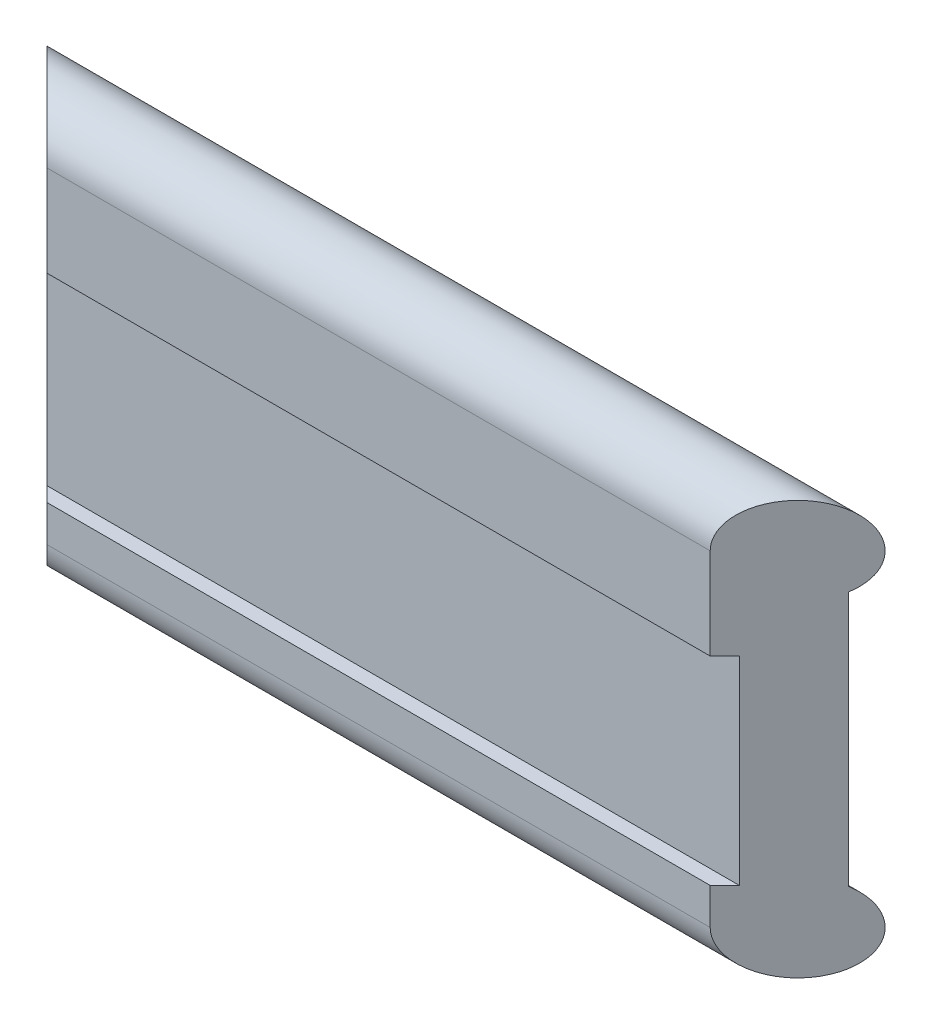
ISO-10303-21;
HEADER;
FILE_DESCRIPTION(('STEP AP214'),'2;1');
FILE_NAME('part.step','',(''),(''),'','','');
FILE_SCHEMA(('AUTOMOTIVE_DESIGN { 1 0 10303 214 1 1 1 1 }'));
ENDSEC;
DATA;
#1=APPLICATION_CONTEXT('core data for automotive mechanical design processes');
#2=APPLICATION_PROTOCOL_DEFINITION('international standard','automotive_design',2000,#1);
#3=PRODUCT_CONTEXT('',#1,'mechanical');
#4=PRODUCT('Part','Part','',(#3));
#5=PRODUCT_RELATED_PRODUCT_CATEGORY('part','',(#4));
#6=PRODUCT_DEFINITION_FORMATION('','',#4);
#7=PRODUCT_DEFINITION_CONTEXT('part definition',#1,'design');
#8=PRODUCT_DEFINITION('design','',#6,#7);
#9=PRODUCT_DEFINITION_SHAPE('','',#8);
#10=(LENGTH_UNIT() NAMED_UNIT(*) SI_UNIT(.MILLI.,.METRE.));
#11=(NAMED_UNIT(*) PLANE_ANGLE_UNIT() SI_UNIT($,.RADIAN.));
#12=(NAMED_UNIT(*) SI_UNIT($,.STERADIAN.) SOLID_ANGLE_UNIT());
#13=UNCERTAINTY_MEASURE_WITH_UNIT(LENGTH_MEASURE(1.E-05),#10,'distance_accuracy_value','');
#14=(GEOMETRIC_REPRESENTATION_CONTEXT(3) GLOBAL_UNCERTAINTY_ASSIGNED_CONTEXT((#13)) GLOBAL_UNIT_ASSIGNED_CONTEXT((#10,
#11,#12)) REPRESENTATION_CONTEXT('',''));
#15=CARTESIAN_POINT('',(0.,0.,0.));
#16=DIRECTION('',(0.,0.,1.));
#17=DIRECTION('',(1.,0.,0.));
#18=AXIS2_PLACEMENT_3D('',#15,#16,#17);
#19=CARTESIAN_POINT('',(0.,0.,15.));
#20=DIRECTION('',(0.,0.,-1.));
#21=DIRECTION('',(-1.,0.,0.));
#22=AXIS2_PLACEMENT_3D('',#19,#20,#21);
#23=PLANE('',#22);
#24=DIRECTION('',(-1.,0.,0.));
#25=VECTOR('',#24,1.);
#26=CARTESIAN_POINT('',(-115.,27.25,15.));
#27=LINE('',#26,#25);
#28=CARTESIAN_POINT('',(95.0000000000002,27.25,15.));
#29=VERTEX_POINT('',#28);
#30=CARTESIAN_POINT('',(-95.0000000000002,27.25,15.));
#31=VERTEX_POINT('',#30);
#32=EDGE_CURVE('E37',#29,#31,#27,.T.);
#33=ORIENTED_EDGE('',*,*,#32,.T.);
#34=DIRECTION('',(0.,-1.,0.));
#35=VECTOR('',#34,1.);
#36=CARTESIAN_POINT('',(-95.0000000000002,0.,15.));
#37=LINE('',#36,#35);
#38=CARTESIAN_POINT('',(-95.0000000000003,-27.25,15.));
#39=VERTEX_POINT('',#38);
#40=EDGE_CURVE('E57',#31,#39,#37,.T.);
#41=ORIENTED_EDGE('',*,*,#40,.T.);
#42=DIRECTION('',(1.,0.,0.));
#43=VECTOR('',#42,1.);
#44=CARTESIAN_POINT('',(-115.,-27.25,15.));
#45=LINE('',#44,#43);
#46=CARTESIAN_POINT('',(95.0000000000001,-27.25,15.));
#47=VERTEX_POINT('',#46);
#48=EDGE_CURVE('E106',#39,#47,#45,.T.);
#49=ORIENTED_EDGE('',*,*,#48,.T.);
#50=DIRECTION('',(0.,1.,0.));
#51=VECTOR('',#50,1.);
#52=CARTESIAN_POINT('',(95.0000000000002,0.,15.));
#53=LINE('',#52,#51);
#54=EDGE_CURVE('E146',#47,#29,#53,.T.);
#55=ORIENTED_EDGE('',*,*,#54,.T.);
#56=EDGE_LOOP('',(#33,#41,#49,#55));
#57=FACE_BOUND('',#56,.T.);
#58=ADVANCED_FACE('F33',(#57),#23,.F.);
#59=CARTESIAN_POINT('',(0.,0.,0.));
#60=DIRECTION('',(0.,0.,-1.));
#61=DIRECTION('',(-1.,0.,0.));
#62=AXIS2_PLACEMENT_3D('',#59,#60,#61);
#63=PLANE('',#62);
#64=DIRECTION('',(0.,-1.,0.));
#65=VECTOR('',#64,1.);
#66=CARTESIAN_POINT('',(-110.,0.,0.));
#67=LINE('',#66,#65);
#68=CARTESIAN_POINT('',(-110.,42.503205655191,0.));
#69=VERTEX_POINT('',#68);
#70=CARTESIAN_POINT('',(-110.,-27.503205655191,0.));
#71=VERTEX_POINT('',#70);
#72=EDGE_CURVE('E159',#69,#71,#67,.T.);
#73=ORIENTED_EDGE('',*,*,#72,.F.);
#74=DIRECTION('',(-1.,0.,0.));
#75=VECTOR('',#74,1.);
#76=CARTESIAN_POINT('',(159.1021541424,42.503205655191,0.));
#77=LINE('',#76,#75);
#78=CARTESIAN_POINT('',(110.,42.503205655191,0.));
#79=VERTEX_POINT('',#78);
#80=EDGE_CURVE('E130',#79,#69,#77,.T.);
#81=ORIENTED_EDGE('',*,*,#80,.F.);
#82=DIRECTION('',(0.,1.,0.));
#83=VECTOR('',#82,1.);
#84=CARTESIAN_POINT('',(110.,0.,0.));
#85=LINE('',#84,#83);
#86=CARTESIAN_POINT('',(110.,-27.503205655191,0.));
#87=VERTEX_POINT('',#86);
#88=EDGE_CURVE('E166',#87,#79,#85,.T.);
#89=ORIENTED_EDGE('',*,*,#88,.F.);
#90=DIRECTION('',(-1.,0.,0.));
#91=VECTOR('',#90,1.);
#92=CARTESIAN_POINT('',(159.1021541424,-27.503205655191,0.));
#93=LINE('',#92,#91);
#94=EDGE_CURVE('E102',#87,#71,#93,.T.);
#95=ORIENTED_EDGE('',*,*,#94,.T.);
#96=EDGE_LOOP('',(#73,#81,#89,#95));
#97=FACE_BOUND('',#96,.T.);
#98=ADVANCED_FACE('F35',(#97),#63,.T.);
#99=CARTESIAN_POINT('',(159.1021541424,27.25,15.));
#100=DIRECTION('',(0.,-1.,0.));
#101=DIRECTION('',(0.,0.,-1.));
#102=AXIS2_PLACEMENT_3D('',#99,#100,#101);
#103=PLANE('',#102);
#104=DIRECTION('',(0.707106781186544,0.,0.707106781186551));
#105=VECTOR('',#104,1.);
#106=CARTESIAN_POINT('',(32.0510770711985,27.25,142.0510770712));
#107=LINE('',#106,#105);
#108=CARTESIAN_POINT('',(-91.0000000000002,27.25,19.));
#109=VERTEX_POINT('',#108);
#110=EDGE_CURVE('E126',#31,#109,#107,.T.);
#111=ORIENTED_EDGE('',*,*,#110,.F.);
#112=ORIENTED_EDGE('',*,*,#32,.F.);
#113=DIRECTION('',(0.707106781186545,0.,-0.70710678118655));
#114=VECTOR('',#113,1.);
#115=CARTESIAN_POINT('',(127.0510770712,27.25,-17.0510770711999));
#116=LINE('',#115,#114);
#117=CARTESIAN_POINT('',(91.0000000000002,27.25,19.));
#118=VERTEX_POINT('',#117);
#119=EDGE_CURVE('E150',#118,#29,#116,.T.);
#120=ORIENTED_EDGE('',*,*,#119,.F.);
#121=DIRECTION('',(-1.,0.,0.));
#122=VECTOR('',#121,1.);
#123=CARTESIAN_POINT('',(159.1021541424,27.25,19.));
#124=LINE('',#123,#122);
#125=EDGE_CURVE('E124',#118,#109,#124,.T.);
#126=ORIENTED_EDGE('',*,*,#125,.T.);
#127=EDGE_LOOP('',(#111,#112,#120,#126));
#128=FACE_BOUND('',#127,.T.);
#129=ADVANCED_FACE('F149',(#128),#103,.T.);
#130=CARTESIAN_POINT('',(159.1021541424,52.25,7.));
#131=DIRECTION('',(-1.,0.,0.));
#132=DIRECTION('',(0.,0.,1.));
#133=AXIS2_PLACEMENT_3D('',#130,#131,#132);
#134=CYLINDRICAL_SURFACE('',#133,12.);
#135=CARTESIAN_POINT('',(-103.,52.25,7.));
#136=DIRECTION('',(0.707106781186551,0.,-0.707106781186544));
#137=DIRECTION('',(-0.707106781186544,0.,-0.707106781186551));
#138=AXIS2_PLACEMENT_3D('',#135,#136,#137);
#139=ELLIPSE('',#138,16.970562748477,12.);
#140=CARTESIAN_POINT('',(-91.0000000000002,52.25,19.));
#141=VERTEX_POINT('',#140);
#142=EDGE_CURVE('E157',#141,#69,#139,.F.);
#143=ORIENTED_EDGE('',*,*,#142,.F.);
#144=DIRECTION('',(-1.,0.,0.));
#145=VECTOR('',#144,1.);
#146=CARTESIAN_POINT('',(159.1021541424,52.25,19.));
#147=LINE('',#146,#145);
#148=CARTESIAN_POINT('',(91.0000000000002,52.25,19.));
#149=VERTEX_POINT('',#148);
#150=EDGE_CURVE('E133',#149,#141,#147,.T.);
#151=ORIENTED_EDGE('',*,*,#150,.F.);
#152=CARTESIAN_POINT('',(103.,52.25,7.));
#153=DIRECTION('',(-0.70710678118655,0.,-0.707106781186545));
#154=DIRECTION('',(-0.707106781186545,0.,0.70710678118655));
#155=AXIS2_PLACEMENT_3D('',#152,#153,#154);
#156=ELLIPSE('',#155,16.9705627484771,12.);
#157=EDGE_CURVE('E164',#79,#149,#156,.F.);
#158=ORIENTED_EDGE('',*,*,#157,.F.);
#159=ORIENTED_EDGE('',*,*,#80,.T.);
#160=EDGE_LOOP('',(#143,#151,#158,#159));
#161=FACE_BOUND('',#160,.T.);
#162=ADVANCED_FACE('F182',(#161),#134,.T.);
#163=CARTESIAN_POINT('',(159.1021541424,27.25,19.));
#164=DIRECTION('',(0.,0.,1.));
#165=DIRECTION('',(0.,-1.,0.));
#166=AXIS2_PLACEMENT_3D('',#163,#164,#165);
#167=PLANE('',#166);
#168=DIRECTION('',(0.,1.,0.));
#169=VECTOR('',#168,1.);
#170=CARTESIAN_POINT('',(-91.0000000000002,-49.25,19.));
#171=LINE('',#170,#169);
#172=EDGE_CURVE('E116',#109,#141,#171,.T.);
#173=ORIENTED_EDGE('',*,*,#172,.F.);
#174=ORIENTED_EDGE('',*,*,#125,.F.);
#175=DIRECTION('',(0.,1.,0.));
#176=VECTOR('',#175,1.);
#177=CARTESIAN_POINT('',(91.0000000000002,-49.25,19.));
#178=LINE('',#177,#176);
#179=EDGE_CURVE('E117',#118,#149,#178,.T.);
#180=ORIENTED_EDGE('',*,*,#179,.T.);
#181=ORIENTED_EDGE('',*,*,#150,.T.);
#182=EDGE_LOOP('',(#173,#174,#180,#181));
#183=FACE_BOUND('',#182,.T.);
#184=ADVANCED_FACE('F175',(#183),#167,.T.);
#185=CARTESIAN_POINT('',(159.1021541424,-27.25,0.));
#186=DIRECTION('',(0.,1.,0.));
#187=DIRECTION('',(0.,0.,1.));
#188=AXIS2_PLACEMENT_3D('',#185,#186,#187);
#189=PLANE('',#188);
#190=DIRECTION('',(-0.707106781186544,0.,-0.707106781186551));
#191=VECTOR('',#190,1.);
#192=CARTESIAN_POINT('',(24.5510770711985,-27.25,134.5510770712));
#193=LINE('',#192,#191);
#194=CARTESIAN_POINT('',(-91.0000000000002,-27.25,19.));
#195=VERTEX_POINT('',#194);
#196=EDGE_CURVE('E153',#195,#39,#193,.T.);
#197=ORIENTED_EDGE('',*,*,#196,.F.);
#198=DIRECTION('',(-1.,0.,0.));
#199=VECTOR('',#198,1.);
#200=CARTESIAN_POINT('',(159.1021541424,-27.25,19.));
#201=LINE('',#200,#199);
#202=CARTESIAN_POINT('',(91.0000000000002,-27.25,19.));
#203=VERTEX_POINT('',#202);
#204=EDGE_CURVE('E122',#203,#195,#201,.T.);
#205=ORIENTED_EDGE('',*,*,#204,.F.);
#206=DIRECTION('',(-0.707106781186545,0.,0.70710678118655));
#207=VECTOR('',#206,1.);
#208=CARTESIAN_POINT('',(134.5510770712,-27.25,-24.5510770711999));
#209=LINE('',#208,#207);
#210=EDGE_CURVE('E112',#47,#203,#209,.T.);
#211=ORIENTED_EDGE('',*,*,#210,.F.);
#212=ORIENTED_EDGE('',*,*,#48,.F.);
#213=EDGE_LOOP('',(#197,#205,#211,#212));
#214=FACE_BOUND('',#213,.T.);
#215=ADVANCED_FACE('F173',(#214),#189,.T.);
#216=CARTESIAN_POINT('',(159.1021541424,-27.25,19.));
#217=DIRECTION('',(0.,0.,1.));
#218=DIRECTION('',(0.,-1.,0.));
#219=AXIS2_PLACEMENT_3D('',#216,#217,#218);
#220=PLANE('',#219);
#221=CARTESIAN_POINT('',(-91.0000000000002,-37.25,19.));
#222=VERTEX_POINT('',#221);
#223=EDGE_CURVE('E121',#222,#195,#171,.T.);
#224=ORIENTED_EDGE('',*,*,#223,.F.);
#225=DIRECTION('',(-1.,0.,0.));
#226=VECTOR('',#225,1.);
#227=CARTESIAN_POINT('',(159.1021541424,-37.25,19.));
#228=LINE('',#227,#226);
#229=CARTESIAN_POINT('',(91.0000000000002,-37.25,19.));
#230=VERTEX_POINT('',#229);
#231=EDGE_CURVE('E100',#230,#222,#228,.T.);
#232=ORIENTED_EDGE('',*,*,#231,.F.);
#233=EDGE_CURVE('E109',#230,#203,#178,.T.);
#234=ORIENTED_EDGE('',*,*,#233,.T.);
#235=ORIENTED_EDGE('',*,*,#204,.T.);
#236=EDGE_LOOP('',(#224,#232,#234,#235));
#237=FACE_BOUND('',#236,.T.);
#238=ADVANCED_FACE('F120',(#237),#220,.T.);
#239=CARTESIAN_POINT('',(159.1021541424,-37.25,7.));
#240=DIRECTION('',(-1.,0.,0.));
#241=DIRECTION('',(0.,0.,1.));
#242=AXIS2_PLACEMENT_3D('',#239,#240,#241);
#243=CYLINDRICAL_SURFACE('',#242,12.);
#244=CARTESIAN_POINT('',(-103.,-37.25,7.));
#245=DIRECTION('',(0.707106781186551,0.,-0.707106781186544));
#246=DIRECTION('',(-0.707106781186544,0.,-0.707106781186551));
#247=AXIS2_PLACEMENT_3D('',#244,#245,#246);
#248=ELLIPSE('',#247,16.970562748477,12.);
#249=EDGE_CURVE('E11',#71,#222,#248,.F.);
#250=ORIENTED_EDGE('',*,*,#249,.F.);
#251=ORIENTED_EDGE('',*,*,#94,.F.);
#252=CARTESIAN_POINT('',(103.,-37.25,7.));
#253=DIRECTION('',(-0.70710678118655,0.,-0.707106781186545));
#254=DIRECTION('',(-0.707106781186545,0.,0.70710678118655));
#255=AXIS2_PLACEMENT_3D('',#252,#253,#254);
#256=ELLIPSE('',#255,16.9705627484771,12.);
#257=EDGE_CURVE('E43',#230,#87,#256,.F.);
#258=ORIENTED_EDGE('',*,*,#257,.F.);
#259=ORIENTED_EDGE('',*,*,#231,.T.);
#260=EDGE_LOOP('',(#250,#251,#258,#259));
#261=FACE_BOUND('',#260,.T.);
#262=ADVANCED_FACE('F98',(#261),#243,.T.);
#263=CARTESIAN_POINT('',(91.0000000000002,-49.25,19.));
#264=DIRECTION('',(-0.70710678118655,0.,-0.707106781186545));
#265=DIRECTION('',(-0.707106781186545,0.,0.70710678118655));
#266=AXIS2_PLACEMENT_3D('',#263,#264,#265);
#267=PLANE('',#266);
#268=ORIENTED_EDGE('',*,*,#119,.T.);
#269=ORIENTED_EDGE('',*,*,#54,.F.);
#270=ORIENTED_EDGE('',*,*,#210,.T.);
#271=ORIENTED_EDGE('',*,*,#233,.F.);
#272=ORIENTED_EDGE('',*,*,#257,.T.);
#273=ORIENTED_EDGE('',*,*,#88,.T.);
#274=ORIENTED_EDGE('',*,*,#157,.T.);
#275=ORIENTED_EDGE('',*,*,#179,.F.);
#276=EDGE_LOOP('',(#268,#269,#270,#271,#272,#273,#274,#275));
#277=FACE_BOUND('',#276,.T.);
#278=ADVANCED_FACE('F110',(#277),#267,.F.);
#279=CARTESIAN_POINT('',(-115.,-49.25,-5.));
#280=DIRECTION('',(0.707106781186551,0.,-0.707106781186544));
#281=DIRECTION('',(-0.707106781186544,0.,-0.707106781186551));
#282=AXIS2_PLACEMENT_3D('',#279,#280,#281);
#283=PLANE('',#282);
#284=ORIENTED_EDGE('',*,*,#110,.T.);
#285=ORIENTED_EDGE('',*,*,#172,.T.);
#286=ORIENTED_EDGE('',*,*,#142,.T.);
#287=ORIENTED_EDGE('',*,*,#72,.T.);
#288=ORIENTED_EDGE('',*,*,#249,.T.);
#289=ORIENTED_EDGE('',*,*,#223,.T.);
#290=ORIENTED_EDGE('',*,*,#196,.T.);
#291=ORIENTED_EDGE('',*,*,#40,.F.);
#292=EDGE_LOOP('',(#284,#285,#286,#287,#288,#289,#290,#291));
#293=FACE_BOUND('',#292,.T.);
#294=ADVANCED_FACE('F171',(#293),#283,.F.);
#295=CLOSED_SHELL('',(#58,#98,#129,#162,#184,#215,#238,#262,#278,#294));
#296=MANIFOLD_SOLID_BREP('B2',#295);
#297=ADVANCED_BREP_SHAPE_REPRESENTATION('',(#18,#296),#14);
#298=SHAPE_DEFINITION_REPRESENTATION(#9,#297);
ENDSEC;
END-ISO-10303-21;
